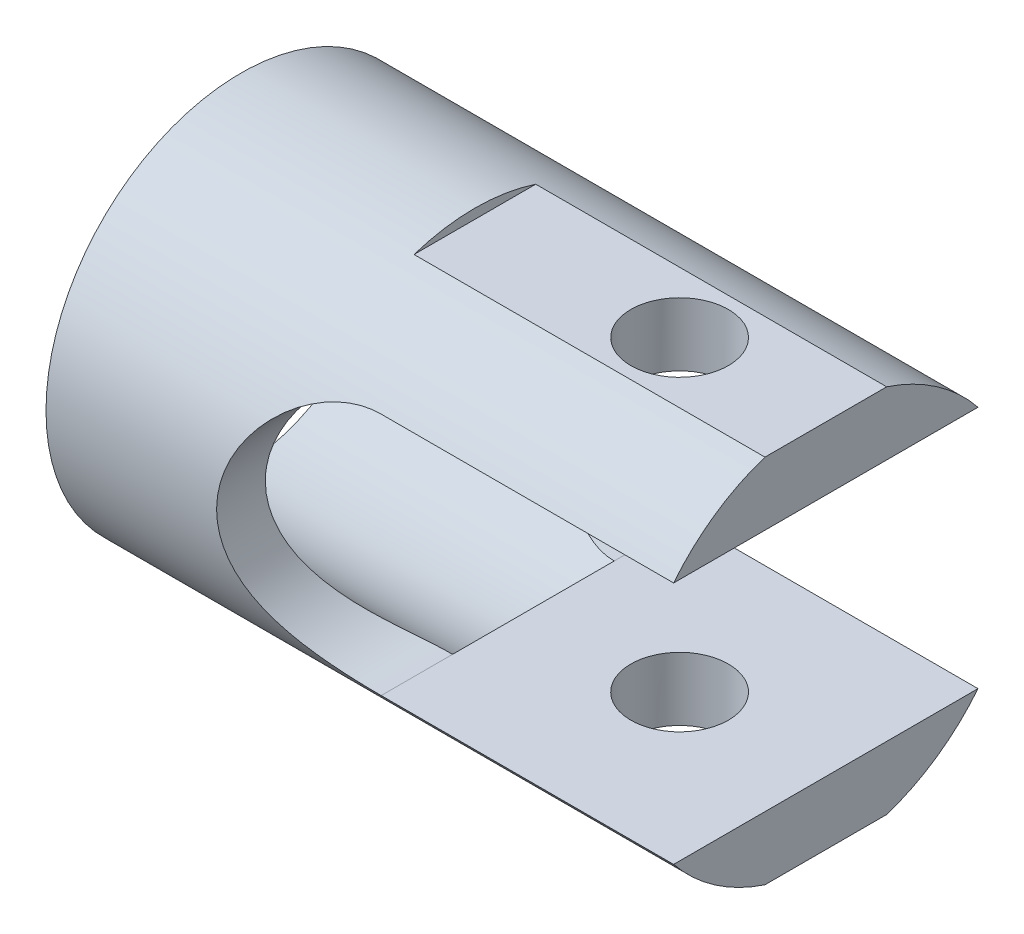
from build123d import *

# Parameters (mm, degrees)
CUT_EXTRUDE1_DEPTH      = 43.121134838
CUT_EXTRUDE1_DEPTH_BACK = 43.121134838
CUT_EXTRUDE2_START      = 15.24
SKETCH3_W               = 25.4
SKETCH3_H               = 5.174194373
SKETCH3_H_2             = 6.603350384
CUT_EXTRUDE2_DEPTH      = 27.881134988
CUT_EXTRUDE3_DEPTH      = 43.121134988
CUT_EXTRUDE3_DEPTH_BACK = 43.121134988
SKETCH4_R               = 3.175


with BuildPart() as part:
    # Sketch1 → Revolve1 (revolve)
    with BuildSketch(Plane.XY, mode=Mode.PRIVATE) as revolve1_sk:
        Polygon((0, 12.7), (38.1, 12.7), (38.1, 9.525), (38.1, 6.35), (19.05, 6.35), (19.05, 9.525), (0, 9.525), align=None)
    revolve(revolve1_sk.sketch.rotate(Axis((-90.197608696, 0, 0), (1, 0, 0)), 90), axis=Axis((-90.197608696, 0, 0), (1, 0, 0)))

    # Sketch2 → Cut-Extrude1 (cut, two sides: drawn at the far end of the back side and taken through both)
    with BuildSketch(Plane.XY.offset(-CUT_EXTRUDE1_DEPTH_BACK)):
        with BuildLine():
            Line((54.217342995, 7.9375), (19.05, 7.9375))
            ThreePointArc((19.05, 7.9375), (11.1125, 0), (19.05, -7.9375))
            Line((19.05, -7.9375), (54.217342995, -7.9375))
            Line((54.217342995, -7.9375), (54.217342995, 7.9375))
        make_face()
    extrude(amount=CUT_EXTRUDE1_DEPTH + CUT_EXTRUDE1_DEPTH_BACK, mode=Mode.SUBTRACT)

    # Sketch3 → Cut-Extrude2 (cut, through all)
    with BuildSketch(Plane(origin=(0, 0, 0), x_dir=(0, 0, -1), z_dir=(1, 0, 0)).offset(CUT_EXTRUDE2_START)):
        with Locations((0, 14.652097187)):
            Rectangle(SKETCH3_W, SKETCH3_H)
        with Locations((0, -15.366675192)):
            Rectangle(SKETCH3_W, SKETCH3_H_2)
    extrude(amount=CUT_EXTRUDE2_DEPTH, mode=Mode.SUBTRACT)

    # Sketch4 → Cut-Extrude3 (cut, two sides: drawn at the far end of the back side and taken through both)
    with BuildSketch(Plane(origin=(0, 0, 0), x_dir=(1, 0, 0), z_dir=(0, 1, 0)).offset(-CUT_EXTRUDE3_DEPTH_BACK)):
        with Locations((28.575, 0)):
            Circle(SKETCH4_R)
    extrude(amount=CUT_EXTRUDE3_DEPTH + CUT_EXTRUDE3_DEPTH_BACK, mode=Mode.SUBTRACT)


solid = part.part
